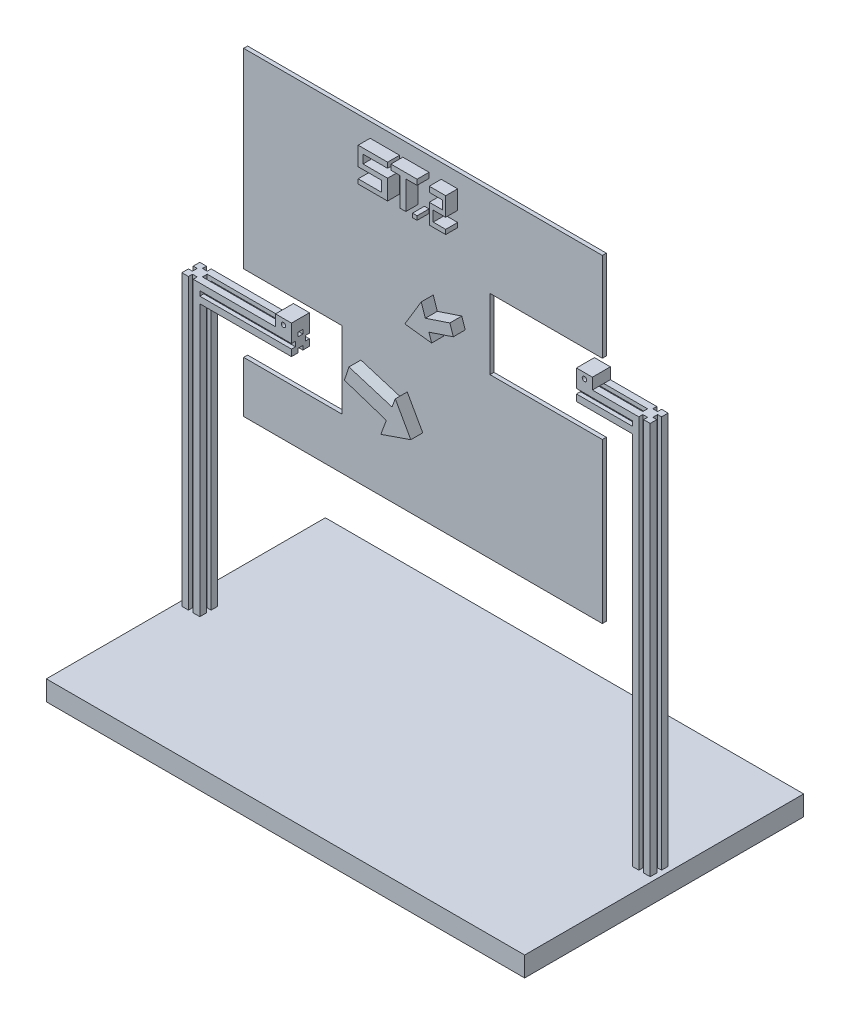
from build123d import *

# Parameters (mm, degrees)
SCHIZZO1_W                        = 1200
SCHIZZO1_H                        = 700
ESTRUSIONE_ESTRUSIONE1_DEPTH      = 50
ESTRUSIONE_ESTRUSIONE2_DEPTH      = 680
ESTRUSIONE_ESTRUSIONE2_DEPTH_BACK = 45
ESTRUSIONE_ESTRUSIONE2_START      = 45
ESTRUSIONE_ESTRUSIONE3_DEPTH      = 985
ESTRUSIONE_ESTRUSIONE4_DEPTH      = 230
SCHIZZO5_W                        = 40
SCHIZZO5_H                        = 45
ESTRUSIONE_ESTRUSIONE5_DEPTH      = 28
SCHIZZO6_R                        = 5.5
TAGLIO_ESTRUSIONE1_DEPTH          = 45
ESTRUSIONE_ESTRUSIONE6_DEPTH      = 140
SCHIZZO8_W                        = 40
SCHIZZO8_H                        = 45
ESTRUSIONE_ESTRUSIONE7_DEPTH      = 28
SCHIZZO9_R                        = 5.5
TAGLIO_ESTRUSIONE2_DEPTH          = 45
ESTRUSIONE_ESTRUSIONE8_DEPTH      = 10
SCHIZZO11_W                       = 11.455508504
SCHIZZO11_H                       = 9.928107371
ESTRUSIONE_ESTRUSIONE9_DEPTH      = 30
ESTRUSIONE_ESTRUSIONE10_DEPTH     = 30
ESTRUSIONE_ESTRUSIONE11_DEPTH     = 30


with BuildPart() as part:
    # Schizzo1 → Estrusione-Estrusione1 (new body)
    with BuildSketch(Plane(origin=(0, 0, 0), x_dir=(1, 0, 0), z_dir=(0, 1, 0))):
        Rectangle(SCHIZZO1_W, SCHIZZO1_H)
    extrude(amount=ESTRUSIONE_ESTRUSIONE1_DEPTH)


with BuildPart() as body_2:
    # Schizzo2 → Estrusione-Estrusione2 (new, two sides: drawn at the far end of the back side and taken through both)
    with BuildSketch(Plane(origin=(0, 50, 0), x_dir=(1, 0, 0), z_dir=(0, 1, 0)).offset(ESTRUSIONE_ESTRUSIONE2_START - ESTRUSIONE_ESTRUSIONE2_DEPTH_BACK)):
        Polygon((-571, 22.5), (-587.5, 22.5), (-587.5, 6), (-577.5, 6), (-577.5, -6), (-587.5, -6), (-587.5, -22.5), (-571, -22.5), (-571, -12.5), (-559, -12.5), (-559, -22.5), (-542.5, -22.5), (-542.5, -6), (-552.5, -6), (-552.5, 6), (-542.5, 6), (-542.5, 22.5), (-559, 22.5), (-559, 12.5), (-571, 12.5), align=None)
    extrude(amount=ESTRUSIONE_ESTRUSIONE2_DEPTH + ESTRUSIONE_ESTRUSIONE2_DEPTH_BACK)

    # Schizzo4 → Estrusione-Estrusione4 (add)
    with BuildSketch(Plane(origin=(-542.5, 0, 0), x_dir=(0, 0, -1), z_dir=(1, 0, 0))):
        Polygon((22.5, 775), (6, 775), (6, 765), (-6, 765), (-6, 740), (6, 740), (6, 730), (22.5, 730), (22.5, 746.5), (12.5, 746.5), (12.5, 758.5), (22.5, 758.5), align=None)
        Polygon((-6, 775), (-22.5, 775), (-22.5, 758.5), (-12.5, 758.5), (-12.5, 746.5), (-22.5, 746.5), (-22.5, 730), (-6, 730), (-6, 740), (-6, 765), align=None)
    extrude(amount=ESTRUSIONE_ESTRUSIONE4_DEPTH)

    # Schizzo5 → Estrusione-Estrusione5 (add)
    with BuildSketch(Plane(origin=(0, 775, 0), x_dir=(1, 0, 0), z_dir=(0, 1, 0))):
        with Locations((-332.5, 0)):
            Rectangle(SCHIZZO5_W, SCHIZZO5_H)
    extrude(amount=ESTRUSIONE_ESTRUSIONE5_DEPTH)

    # Schizzo6 → Taglio-Estrusione1 (cut)
    with BuildSketch(Plane.XY.offset(22.5)):
        with Locations((-332.5, 789)):
            Circle(SCHIZZO6_R)
    extrude(amount=-TAGLIO_ESTRUSIONE1_DEPTH, mode=Mode.SUBTRACT)


with BuildPart() as body_3:
    # Schizzo3 → Estrusione-Estrusione3 (new body)
    with BuildSketch(Plane(origin=(0, 50, 0), x_dir=(1, 0, 0), z_dir=(0, 1, 0))):
        Polygon((559, 22.5), (542.5, 22.5), (542.5, 6), (552.5, 6), (552.5, -6), (542.5, -6), (542.5, -22.5), (559, -22.5), (559, -12.5), (571, -12.5), (571, -22.5), (587.5, -22.5), (587.5, -6), (577.5, -6), (577.5, 6), (587.5, 6), (587.5, 22.5), (571, 22.5), (571, 12.5), (559, 12.5), align=None)
    extrude(amount=ESTRUSIONE_ESTRUSIONE3_DEPTH)

    # Schizzo7 → Estrusione-Estrusione6 (add)
    with BuildSketch(Plane.ZY.offset(-542.5)):
        Polygon((22.5, 1035), (6, 1035), (6, 1025), (6, 1000), (6, 990), (22.5, 990), (22.5, 1006.5), (12.5, 1006.5), (12.5, 1018.5), (22.5, 1018.5), align=None)
        Polygon((-6, 1035), (-22.5, 1035), (-22.5, 1018.5), (-12.5, 1018.5), (-12.5, 1006.5), (-22.5, 1006.5), (-22.5, 990), (-6, 990), (-6, 1000), (6, 1000), (6, 1025), (-6, 1025), align=None)
    extrude(amount=ESTRUSIONE_ESTRUSIONE6_DEPTH)

    # Schizzo8 → Estrusione-Estrusione7 (add)
    with BuildSketch(Plane(origin=(0, 1035, 0), x_dir=(1, 0, 0), z_dir=(0, 1, 0))):
        with Locations((422.5, 0)):
            Rectangle(SCHIZZO8_W, SCHIZZO8_H)
    extrude(amount=ESTRUSIONE_ESTRUSIONE7_DEPTH)

    # Schizzo9 → Taglio-Estrusione2 (cut)
    with BuildSketch(Plane.XY.offset(22.5)):
        with Locations((422.5, 1049)):
            Circle(SCHIZZO9_R)
    extrude(amount=-TAGLIO_ESTRUSIONE2_DEPTH, mode=Mode.SUBTRACT)


with BuildPart() as body_4:
    # Schizzo10 → Estrusione-Estrusione8 (new body)
    with BuildSketch(Plane.XY.offset(22.5)):
        Polygon((-422.552277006, 1350), (477.447722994, 1350), (477.447722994, 1126.471016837), (195.424355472, 1126.471016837), (195.424355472, 950), (477.447722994, 950), (477.447722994, 550), (-422.552277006, 550), (-422.552277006, 678.522000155), (-175.130328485, 678.522000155), (-175.130328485, 870.835190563), (-422.552277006, 870.835190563), align=None)
    extrude(amount=ESTRUSIONE_ESTRUSIONE8_DEPTH)

    # Schizzo11 → Estrusione-Estrusione9 (add)
    with BuildSketch(Plane.XY.offset(32.5)):
        Polygon((-105.14517176, 1313.223906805), (-31.39004955, 1313.223906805), (-31.39004955, 1299.813884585), (-93.076151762, 1299.813884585), (-93.076151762, 1278.357849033), (-31.39004955, 1278.357849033), (-31.39004955, 1228.740766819), (-105.14517176, 1228.740766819), (-105.14517176, 1240.139285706), (-46.141073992, 1240.139285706), (-46.141073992, 1266.288829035), (-105.14517176, 1266.288829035), align=None)
        Polygon((0, 1228.740766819), (14.35923213, 1228.740766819), (14.35923213, 1299.813884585), (42.616153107, 1299.813884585), (42.616153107, 1313.223906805), (-23.062095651, 1313.223906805), (-23.062095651, 1299.813884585), (0, 1299.813884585), align=None)
        Polygon((73.164175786, 1313.223906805), (73.164175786, 1299.813884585), (106.767000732, 1299.813884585), (106.767000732, 1278.357849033), (73.164175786, 1278.357849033), (73.164175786, 1228.740766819), (114.404006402, 1228.740766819), (114.404006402, 1240.139285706), (83.092283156, 1240.139285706), (83.092283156, 1266.288829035), (114.404006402, 1266.288829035), (114.404006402, 1313.223906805), align=None)
        with Locations((36.888398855, 1228.754969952)):
            Rectangle(SCHIZZO11_W, SCHIZZO11_H)
    extrude(amount=ESTRUSIONE_ESTRUSIONE9_DEPTH)

    # Schizzo12 → Estrusione-Estrusione10 (add)
    with BuildSketch(Plane.XY.offset(32.5)):
        Polygon((63.410989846, 1021.471140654), (124.819450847, 1041.940627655), (133.434668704, 1016.094974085), (72.16325436, 995.671169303), (79.059945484, 975.341066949), (11.935083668, 983.399179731), (53.101941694, 1051.860206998), align=None)
    extrude(amount=ESTRUSIONE_ESTRUSIONE10_DEPTH)

    # Schizzo13 → Estrusione-Estrusione11 (add)
    with BuildSketch(Plane.XY.offset(32.5)):
        Polygon((-139.702748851, 785.24301288), (-34.478087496, 750.669195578), (-48.32911407, 713.347462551), (26.883405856, 739.264169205), (-12.084479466, 808.619073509), (-20.365111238, 786.852841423), (-128.342780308, 819.816830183), align=None)
    extrude(amount=ESTRUSIONE_ESTRUSIONE11_DEPTH)


solid = Compound([part.part, body_2.part, body_3.part, body_4.part])
